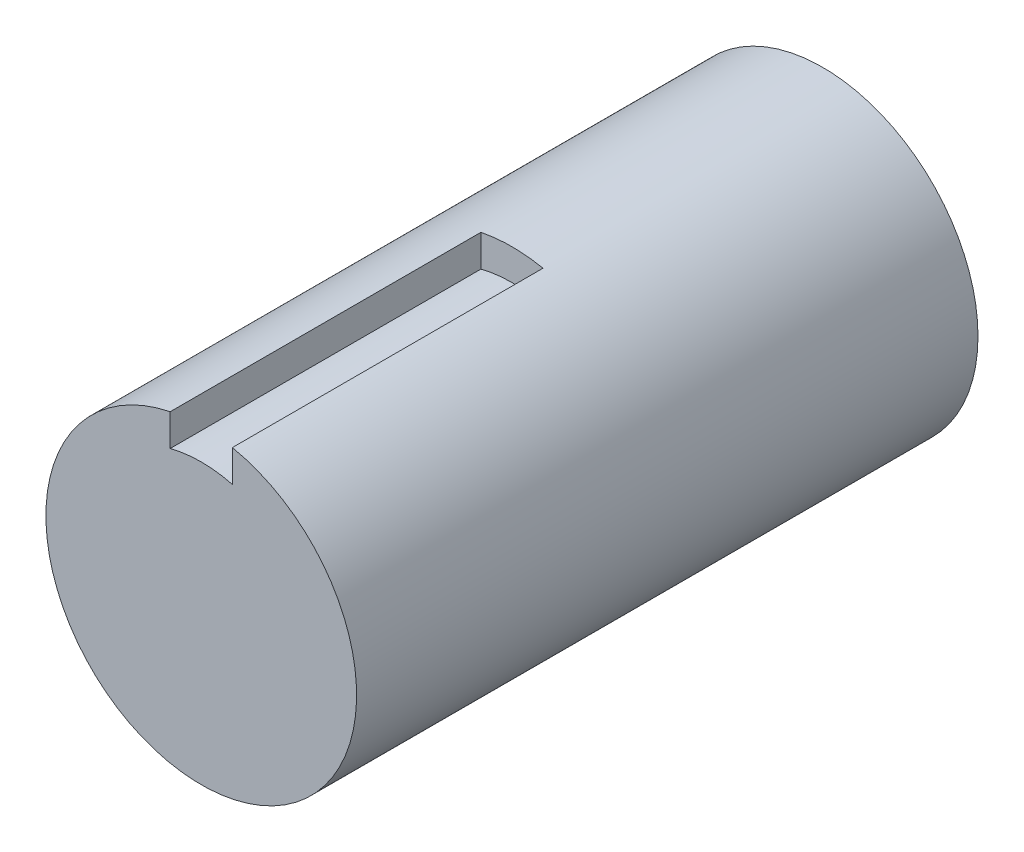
from build123d import *

# Parameters (mm, degrees)
SZKIC1_R                    = 50
DODANIE_WYCI_GNI_CIE1_DEPTH = 200
WYCI_CIE_START              = -100
WYCI_CIE_ROWKA_DEPTH        = 100


with BuildPart() as part:
    # Szkic1 → Dodanie-wyci_gni_cie1 (new body)
    with BuildSketch(Plane.XY):
        Circle(SZKIC1_R)
    extrude(amount=DODANIE_WYCI_GNI_CIE1_DEPTH)

    # Szkic2 → Wyci_cie rowka (cut)
    with BuildSketch(Plane.XY.offset(200).offset(WYCI_CIE_START)):
        with BuildLine():
            Line((-10, 48.989794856), (-10, 38.729833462))
            ThreePointArc((-10, 38.729833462), (0, 40), (10, 38.729833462))
            Line((10, 38.729833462), (10, 48.989794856))
            ThreePointArc((10, 48.989794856), (0, 50), (-10, 48.989794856))
        make_face()
    extrude(amount=WYCI_CIE_ROWKA_DEPTH, mode=Mode.SUBTRACT)


solid = part.part
